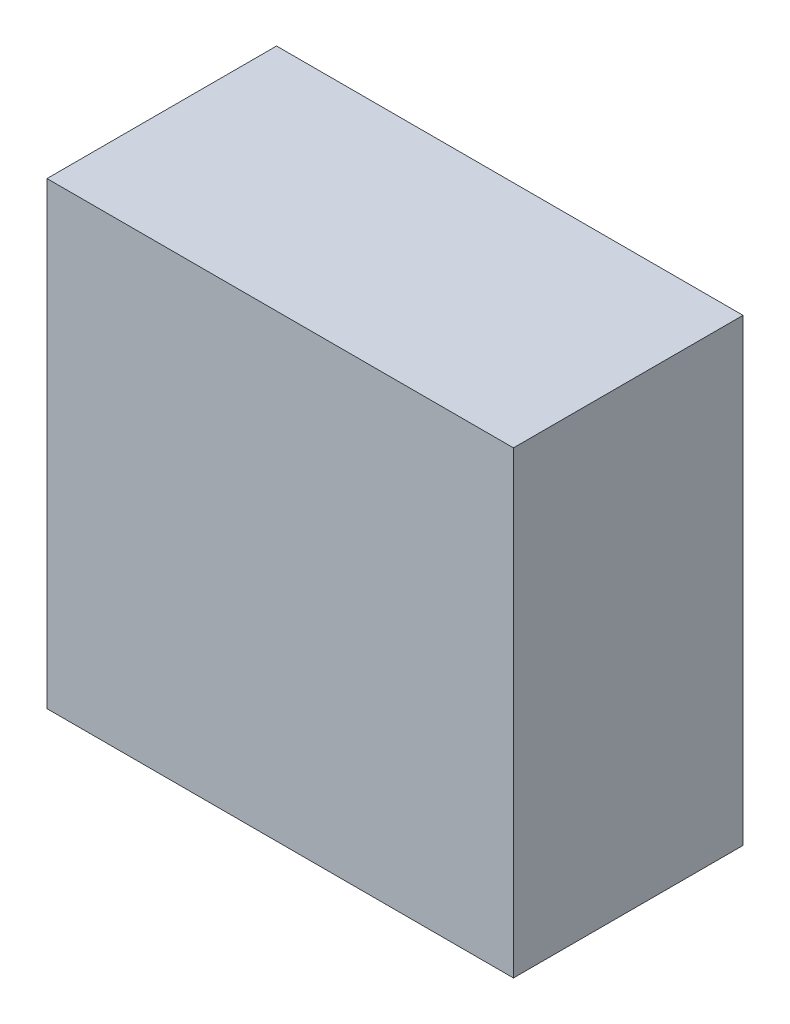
ISO-10303-21;
HEADER;
FILE_DESCRIPTION(('STEP AP214'),'2;1');
FILE_NAME('part.step','',(''),(''),'','','');
FILE_SCHEMA(('AUTOMOTIVE_DESIGN { 1 0 10303 214 1 1 1 1 }'));
ENDSEC;
DATA;
#1=APPLICATION_CONTEXT('core data for automotive mechanical design processes');
#2=APPLICATION_PROTOCOL_DEFINITION('international standard','automotive_design',2000,#1);
#3=PRODUCT_CONTEXT('',#1,'mechanical');
#4=PRODUCT('Part','Part','',(#3));
#5=PRODUCT_RELATED_PRODUCT_CATEGORY('part','',(#4));
#6=PRODUCT_DEFINITION_FORMATION('','',#4);
#7=PRODUCT_DEFINITION_CONTEXT('part definition',#1,'design');
#8=PRODUCT_DEFINITION('design','',#6,#7);
#9=PRODUCT_DEFINITION_SHAPE('','',#8);
#10=(LENGTH_UNIT() NAMED_UNIT(*) SI_UNIT(.MILLI.,.METRE.));
#11=(NAMED_UNIT(*) PLANE_ANGLE_UNIT() SI_UNIT($,.RADIAN.));
#12=(NAMED_UNIT(*) SI_UNIT($,.STERADIAN.) SOLID_ANGLE_UNIT());
#13=UNCERTAINTY_MEASURE_WITH_UNIT(LENGTH_MEASURE(1.E-05),#10,'distance_accuracy_value','');
#14=(GEOMETRIC_REPRESENTATION_CONTEXT(3) GLOBAL_UNCERTAINTY_ASSIGNED_CONTEXT((#13)) GLOBAL_UNIT_ASSIGNED_CONTEXT((#10,
#11,#12)) REPRESENTATION_CONTEXT('',''));
#15=CARTESIAN_POINT('',(0.,0.,0.));
#16=DIRECTION('',(0.,0.,1.));
#17=DIRECTION('',(1.,0.,0.));
#18=AXIS2_PLACEMENT_3D('',#15,#16,#17);
#19=CARTESIAN_POINT('',(203.2,-100.,50.));
#20=DIRECTION('',(0.,0.,1.));
#21=DIRECTION('',(1.,0.,0.));
#22=AXIS2_PLACEMENT_3D('',#19,#20,#21);
#23=PLANE('',#22);
#24=DIRECTION('',(0.,1.,0.));
#25=VECTOR('',#24,1.);
#26=CARTESIAN_POINT('',(0.,-100.,50.));
#27=LINE('',#26,#25);
#28=CARTESIAN_POINT('',(0.,-100.,50.));
#29=VERTEX_POINT('',#28);
#30=CARTESIAN_POINT('',(0.,100.,50.));
#31=VERTEX_POINT('',#30);
#32=EDGE_CURVE('E117',#29,#31,#27,.T.);
#33=ORIENTED_EDGE('',*,*,#32,.F.);
#34=DIRECTION('',(-1.,0.,0.));
#35=VECTOR('',#34,1.);
#36=CARTESIAN_POINT('',(203.2,-100.,50.));
#37=LINE('',#36,#35);
#38=CARTESIAN_POINT('',(203.2,-100.,50.));
#39=VERTEX_POINT('',#38);
#40=EDGE_CURVE('E11',#39,#29,#37,.T.);
#41=ORIENTED_EDGE('',*,*,#40,.F.);
#42=DIRECTION('',(0.,1.,0.));
#43=VECTOR('',#42,1.);
#44=CARTESIAN_POINT('',(203.2,-100.,50.));
#45=LINE('',#44,#43);
#46=CARTESIAN_POINT('',(203.2,100.,50.));
#47=VERTEX_POINT('',#46);
#48=EDGE_CURVE('E110',#39,#47,#45,.T.);
#49=ORIENTED_EDGE('',*,*,#48,.T.);
#50=DIRECTION('',(-1.,0.,0.));
#51=VECTOR('',#50,1.);
#52=CARTESIAN_POINT('',(203.2,100.,50.));
#53=LINE('',#52,#51);
#54=EDGE_CURVE('E49',#47,#31,#53,.T.);
#55=ORIENTED_EDGE('',*,*,#54,.T.);
#56=EDGE_LOOP('',(#33,#41,#49,#55));
#57=FACE_BOUND('',#56,.T.);
#58=ADVANCED_FACE('F46',(#57),#23,.T.);
#59=CARTESIAN_POINT('',(203.2,-100.,50.));
#60=DIRECTION('',(0.,1.,0.));
#61=DIRECTION('',(0.,0.,1.));
#62=AXIS2_PLACEMENT_3D('',#59,#60,#61);
#63=PLANE('',#62);
#64=DIRECTION('',(0.,0.,-1.));
#65=VECTOR('',#64,1.);
#66=CARTESIAN_POINT('',(0.,-100.,50.));
#67=LINE('',#66,#65);
#68=CARTESIAN_POINT('',(0.,-100.,-50.));
#69=VERTEX_POINT('',#68);
#70=EDGE_CURVE('E80',#29,#69,#67,.T.);
#71=ORIENTED_EDGE('',*,*,#70,.T.);
#72=DIRECTION('',(-1.,0.,0.));
#73=VECTOR('',#72,1.);
#74=CARTESIAN_POINT('',(203.2,-100.,-50.));
#75=LINE('',#74,#73);
#76=CARTESIAN_POINT('',(203.2,-100.,-50.));
#77=VERTEX_POINT('',#76);
#78=EDGE_CURVE('E56',#77,#69,#75,.T.);
#79=ORIENTED_EDGE('',*,*,#78,.F.);
#80=DIRECTION('',(0.,0.,-1.));
#81=VECTOR('',#80,1.);
#82=CARTESIAN_POINT('',(203.2,-100.,50.));
#83=LINE('',#82,#81);
#84=EDGE_CURVE('E97',#39,#77,#83,.T.);
#85=ORIENTED_EDGE('',*,*,#84,.F.);
#86=ORIENTED_EDGE('',*,*,#40,.T.);
#87=EDGE_LOOP('',(#71,#79,#85,#86));
#88=FACE_BOUND('',#87,.T.);
#89=ADVANCED_FACE('F133',(#88),#63,.F.);
#90=CARTESIAN_POINT('',(203.2,-100.,-50.));
#91=DIRECTION('',(0.,0.,1.));
#92=DIRECTION('',(1.,0.,0.));
#93=AXIS2_PLACEMENT_3D('',#90,#91,#92);
#94=PLANE('',#93);
#95=DIRECTION('',(0.,1.,0.));
#96=VECTOR('',#95,1.);
#97=CARTESIAN_POINT('',(0.,-100.,-50.));
#98=LINE('',#97,#96);
#99=CARTESIAN_POINT('',(0.,100.,-50.));
#100=VERTEX_POINT('',#99);
#101=EDGE_CURVE('E105',#69,#100,#98,.T.);
#102=ORIENTED_EDGE('',*,*,#101,.T.);
#103=DIRECTION('',(-1.,0.,0.));
#104=VECTOR('',#103,1.);
#105=CARTESIAN_POINT('',(203.2,100.,-50.));
#106=LINE('',#105,#104);
#107=CARTESIAN_POINT('',(203.2,100.,-50.));
#108=VERTEX_POINT('',#107);
#109=EDGE_CURVE('E102',#108,#100,#106,.T.);
#110=ORIENTED_EDGE('',*,*,#109,.F.);
#111=DIRECTION('',(0.,1.,0.));
#112=VECTOR('',#111,1.);
#113=CARTESIAN_POINT('',(203.2,-100.,-50.));
#114=LINE('',#113,#112);
#115=EDGE_CURVE('E92',#77,#108,#114,.T.);
#116=ORIENTED_EDGE('',*,*,#115,.F.);
#117=ORIENTED_EDGE('',*,*,#78,.T.);
#118=EDGE_LOOP('',(#102,#110,#116,#117));
#119=FACE_BOUND('',#118,.T.);
#120=ADVANCED_FACE('F103',(#119),#94,.F.);
#121=CARTESIAN_POINT('',(203.2,100.,50.));
#122=DIRECTION('',(0.,1.,0.));
#123=DIRECTION('',(0.,0.,1.));
#124=AXIS2_PLACEMENT_3D('',#121,#122,#123);
#125=PLANE('',#124);
#126=DIRECTION('',(0.,0.,-1.));
#127=VECTOR('',#126,1.);
#128=CARTESIAN_POINT('',(0.,100.,50.));
#129=LINE('',#128,#127);
#130=EDGE_CURVE('E121',#31,#100,#129,.T.);
#131=ORIENTED_EDGE('',*,*,#130,.F.);
#132=ORIENTED_EDGE('',*,*,#54,.F.);
#133=DIRECTION('',(0.,0.,-1.));
#134=VECTOR('',#133,1.);
#135=CARTESIAN_POINT('',(203.2,100.,50.));
#136=LINE('',#135,#134);
#137=EDGE_CURVE('E96',#47,#108,#136,.T.);
#138=ORIENTED_EDGE('',*,*,#137,.T.);
#139=ORIENTED_EDGE('',*,*,#109,.T.);
#140=EDGE_LOOP('',(#131,#132,#138,#139));
#141=FACE_BOUND('',#140,.T.);
#142=ADVANCED_FACE('F108',(#141),#125,.T.);
#143=CARTESIAN_POINT('',(203.2,0.,0.));
#144=DIRECTION('',(-1.,0.,0.));
#145=DIRECTION('',(0.,0.,1.));
#146=AXIS2_PLACEMENT_3D('',#143,#144,#145);
#147=PLANE('',#146);
#148=ORIENTED_EDGE('',*,*,#48,.F.);
#149=ORIENTED_EDGE('',*,*,#84,.T.);
#150=ORIENTED_EDGE('',*,*,#115,.T.);
#151=ORIENTED_EDGE('',*,*,#137,.F.);
#152=EDGE_LOOP('',(#148,#149,#150,#151));
#153=FACE_BOUND('',#152,.T.);
#154=ADVANCED_FACE('F95',(#153),#147,.F.);
#155=CARTESIAN_POINT('',(0.,0.,0.));
#156=DIRECTION('',(-1.,0.,0.));
#157=DIRECTION('',(0.,0.,1.));
#158=AXIS2_PLACEMENT_3D('',#155,#156,#157);
#159=PLANE('',#158);
#160=ORIENTED_EDGE('',*,*,#32,.T.);
#161=ORIENTED_EDGE('',*,*,#130,.T.);
#162=ORIENTED_EDGE('',*,*,#101,.F.);
#163=ORIENTED_EDGE('',*,*,#70,.F.);
#164=EDGE_LOOP('',(#160,#161,#162,#163));
#165=FACE_BOUND('',#164,.T.);
#166=ADVANCED_FACE('F130',(#165),#159,.T.);
#167=CLOSED_SHELL('',(#58,#89,#120,#142,#154,#166));
#168=MANIFOLD_SOLID_BREP('B2',#167);
#169=ADVANCED_BREP_SHAPE_REPRESENTATION('',(#18,#168),#14);
#170=SHAPE_DEFINITION_REPRESENTATION(#9,#169);
ENDSEC;
END-ISO-10303-21;
